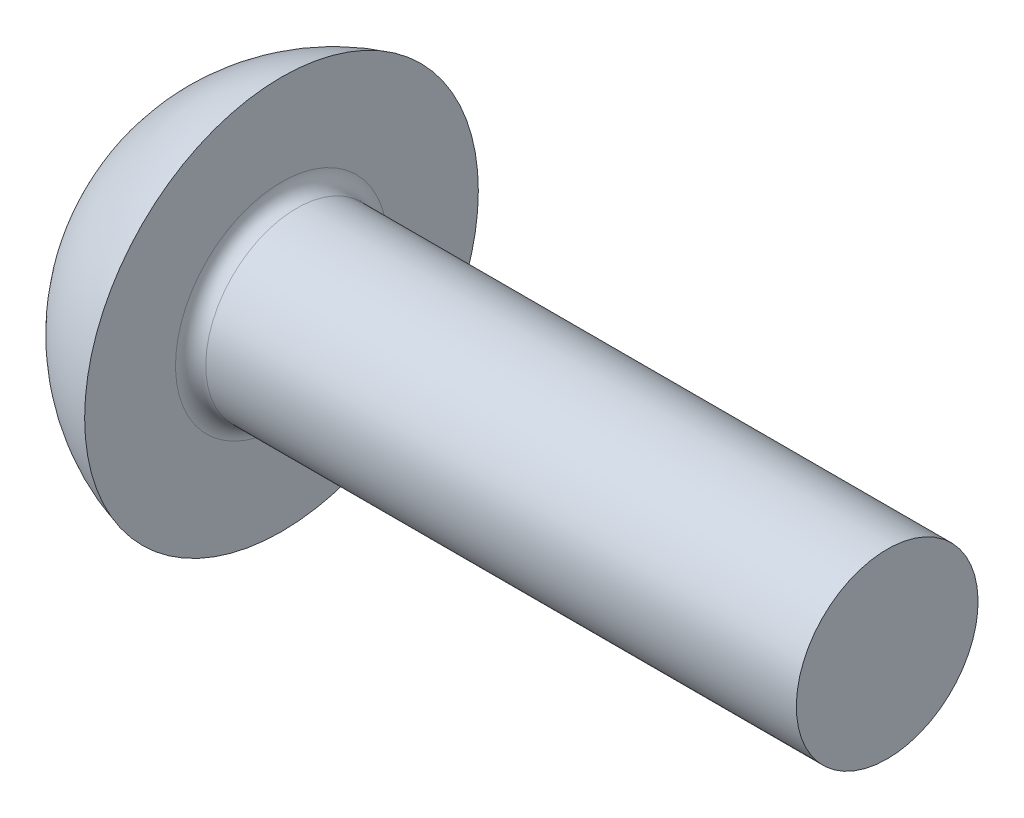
ISO-10303-21;
HEADER;
FILE_DESCRIPTION(('STEP AP214'),'2;1');
FILE_NAME('part.step','',(''),(''),'','','');
FILE_SCHEMA(('AUTOMOTIVE_DESIGN { 1 0 10303 214 1 1 1 1 }'));
ENDSEC;
DATA;
#1=APPLICATION_CONTEXT('core data for automotive mechanical design processes');
#2=APPLICATION_PROTOCOL_DEFINITION('international standard','automotive_design',2000,#1);
#3=PRODUCT_CONTEXT('',#1,'mechanical');
#4=PRODUCT('Part','Part','',(#3));
#5=PRODUCT_RELATED_PRODUCT_CATEGORY('part','',(#4));
#6=PRODUCT_DEFINITION_FORMATION('','',#4);
#7=PRODUCT_DEFINITION_CONTEXT('part definition',#1,'design');
#8=PRODUCT_DEFINITION('design','',#6,#7);
#9=PRODUCT_DEFINITION_SHAPE('','',#8);
#10=(LENGTH_UNIT() NAMED_UNIT(*) SI_UNIT(.MILLI.,.METRE.));
#11=(NAMED_UNIT(*) PLANE_ANGLE_UNIT() SI_UNIT($,.RADIAN.));
#12=(NAMED_UNIT(*) SI_UNIT($,.STERADIAN.) SOLID_ANGLE_UNIT());
#13=UNCERTAINTY_MEASURE_WITH_UNIT(LENGTH_MEASURE(1.E-05),#10,'distance_accuracy_value','');
#14=(GEOMETRIC_REPRESENTATION_CONTEXT(3) GLOBAL_UNCERTAINTY_ASSIGNED_CONTEXT((#13)) GLOBAL_UNIT_ASSIGNED_CONTEXT((#10,
#11,#12)) REPRESENTATION_CONTEXT('',''));
#15=CARTESIAN_POINT('',(0.,0.,0.));
#16=DIRECTION('',(0.,0.,1.));
#17=DIRECTION('',(1.,0.,0.));
#18=AXIS2_PLACEMENT_3D('',#15,#16,#17);
#19=CARTESIAN_POINT('',(2.5,0.,0.));
#20=DIRECTION('',(-1.,0.,0.));
#21=DIRECTION('',(0.,-1.,0.));
#22=AXIS2_PLACEMENT_3D('',#19,#20,#21);
#23=PLANE('',#22);
#24=CARTESIAN_POINT('',(2.5,0.,0.));
#25=DIRECTION('',(-1.,0.,0.));
#26=DIRECTION('',(0.,-1.,0.));
#27=AXIS2_PLACEMENT_3D('',#24,#25,#26);
#28=CIRCLE('',#27,0.3);
#29=CARTESIAN_POINT('',(2.5,-0.299999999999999,0.));
#30=VERTEX_POINT('',#29);
#31=EDGE_CURVE('E46',#30,#30,#28,.T.);
#32=ORIENTED_EDGE('',*,*,#31,.F.);
#33=EDGE_LOOP('',(#32));
#34=FACE_BOUND('',#33,.T.);
#35=ADVANCED_FACE('F31',(#34),#23,.F.);
#36=CARTESIAN_POINT('',(0.672499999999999,0.,0.));
#37=DIRECTION('',(-1.,0.,0.));
#38=DIRECTION('',(0.,1.,0.));
#39=AXIS2_PLACEMENT_3D('',#36,#37,#38);
#40=SPHERICAL_SURFACE('',#39,0.6725);
#41=CARTESIAN_POINT('',(0.5,0.,0.));
#42=DIRECTION('',(-1.,0.,0.));
#43=DIRECTION('',(0.,-1.,0.));
#44=AXIS2_PLACEMENT_3D('',#41,#42,#43);
#45=CIRCLE('',#44,0.65);
#46=CARTESIAN_POINT('',(0.5,-0.649999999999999,0.));
#47=VERTEX_POINT('',#46);
#48=EDGE_CURVE('E42',#47,#47,#45,.T.);
#49=ORIENTED_EDGE('',*,*,#48,.T.);
#50=EDGE_LOOP('',(#49));
#51=FACE_BOUND('',#50,.T.);
#52=ADVANCED_FACE('F55',(#51),#40,.T.);
#53=CARTESIAN_POINT('',(0.5,0.65,0.));
#54=DIRECTION('',(-1.,0.,0.));
#55=DIRECTION('',(0.,-1.,0.));
#56=AXIS2_PLACEMENT_3D('',#53,#54,#55);
#57=PLANE('',#56);
#58=CARTESIAN_POINT('',(0.5,0.,0.));
#59=DIRECTION('',(-1.,0.,0.));
#60=DIRECTION('',(0.,-1.,0.));
#61=AXIS2_PLACEMENT_3D('',#58,#59,#60);
#62=CIRCLE('',#61,0.35);
#63=CARTESIAN_POINT('',(0.5,-0.349999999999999,0.));
#64=VERTEX_POINT('',#63);
#65=EDGE_CURVE('E38',#64,#64,#62,.T.);
#66=ORIENTED_EDGE('',*,*,#65,.T.);
#67=EDGE_LOOP('',(#66));
#68=FACE_BOUND('',#67,.T.);
#69=ORIENTED_EDGE('',*,*,#48,.F.);
#70=EDGE_LOOP('',(#69));
#71=FACE_BOUND('',#70,.T.);
#72=ADVANCED_FACE('F59',(#68,#71),#57,.F.);
#73=CARTESIAN_POINT('',(-3.989694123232,0.,0.));
#74=DIRECTION('',(-1.,0.,0.));
#75=DIRECTION('',(0.,-1.,0.));
#76=AXIS2_PLACEMENT_3D('',#73,#74,#75);
#77=CYLINDRICAL_SURFACE('',#76,0.3);
#78=CARTESIAN_POINT('',(0.55,0.,0.));
#79=DIRECTION('',(-1.,0.,0.));
#80=DIRECTION('',(0.,-1.,0.));
#81=AXIS2_PLACEMENT_3D('',#78,#79,#80);
#82=CIRCLE('',#81,0.3);
#83=CARTESIAN_POINT('',(0.55,-0.299999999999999,0.));
#84=VERTEX_POINT('',#83);
#85=EDGE_CURVE('E10',#84,#84,#82,.F.);
#86=ORIENTED_EDGE('',*,*,#85,.T.);
#87=EDGE_LOOP('',(#86));
#88=FACE_BOUND('',#87,.T.);
#89=ORIENTED_EDGE('',*,*,#31,.T.);
#90=EDGE_LOOP('',(#89));
#91=FACE_BOUND('',#90,.T.);
#92=ADVANCED_FACE('F52',(#88,#91),#77,.T.);
#93=CARTESIAN_POINT('',(0.55,0.,0.));
#94=DIRECTION('',(-1.,0.,0.));
#95=DIRECTION('',(0.,-1.,0.));
#96=AXIS2_PLACEMENT_3D('',#93,#94,#95);
#97=TOROIDAL_SURFACE('',#96,0.35,0.05);
#98=ORIENTED_EDGE('',*,*,#85,.F.);
#99=EDGE_LOOP('',(#98));
#100=FACE_BOUND('',#99,.T.);
#101=ORIENTED_EDGE('',*,*,#65,.F.);
#102=EDGE_LOOP('',(#101));
#103=FACE_BOUND('',#102,.T.);
#104=ADVANCED_FACE('F33',(#100,#103),#97,.F.);
#105=CLOSED_SHELL('',(#35,#52,#72,#92,#104));
#106=MANIFOLD_SOLID_BREP('B2',#105);
#107=ADVANCED_BREP_SHAPE_REPRESENTATION('',(#18,#106),#14);
#108=SHAPE_DEFINITION_REPRESENTATION(#9,#107);
ENDSEC;
END-ISO-10303-21;
